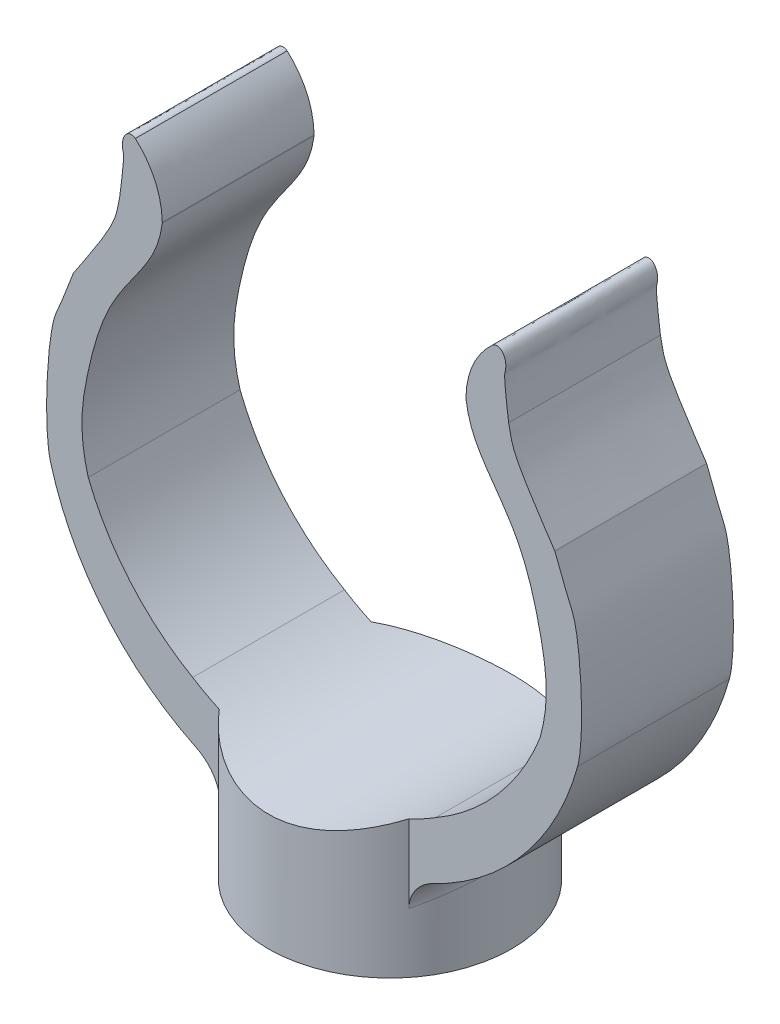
from build123d import *

# Parameters (mm, degrees)
BOSS_EXTRU_1_DEPTH      = 5
ESQUISSE2_W             = 8
ESQUISSE2_H             = 10
ENL_V_MAT_EXTRU_1_DEPTH = 10
CONG_2_R                = 2


with BuildPart() as part:
    # Esquisse1 → Boss.-Extru.1 (new, symmetric)
    with BuildSketch(Plane.XY):
        with BuildLine():
            Line((10, 27.051223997), (10, 27.101223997))
            add(Edge.make_bspline(
                [(10, 27.101223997), (10.056682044, 29.410917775), (11.772588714, 31)],
                knots=[0, 0, 0, 1, 1, 1], degree=2))
            add(Edge.make_bspline(
                [(12.814067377, 27.071239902), (12.812837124, 27.093816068), (12.484605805, 29.498084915), (12.615706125, 29.965612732), (12.703970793, 30.674854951), (12.189630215, 31.268516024), (11.772588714, 31)],
                knots=[0, 0, 0, 0, 0.319811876, 0.380234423, 0.604225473, 1, 1, 1, 1], degree=3))
            add(Edge.make_bspline(
                [(15.857886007, 21.276446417), (15.852969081, 21.289757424), (12.727655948, 25.890453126), (13.04722311, 26.185248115), (12.814067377, 27.071239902)],
                knots=[0.213455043, 0.213455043, 0.213455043, 0.213455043, 0.458677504, 1, 1, 1, 1], degree=3))
            add(Edge.make_bspline(
                [(15.857886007, 21.276446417), (16.544749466, 19.4169829), (16.946927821, 18.638172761), (17.575313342, 16.625727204), (17.823461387, 11.432994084), (17.359175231, 9.739849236)],
                knots=[0, 0, 0, 0, 0.210543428, 0.310543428, 1, 1, 1, 1], degree=3))
            ThreePointArc((17.359175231, 9.739849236), (0, -3.5), (-17.359175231, 9.739849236))
            add(Edge.make_bspline(
                [(-15.857886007, 21.276446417), (-16.544749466, 19.4169829), (-16.946927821, 18.638172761), (-17.575313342, 16.625727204), (-17.823461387, 11.432994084), (-17.359175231, 9.739849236)],
                knots=[0, 0, 0, 0, 0.210543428, 0.310543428, 1, 1, 1, 1], degree=3))
            add(Edge.make_bspline(
                [(-15.857886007, 21.276446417), (-15.852969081, 21.289757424), (-12.727655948, 25.890453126), (-13.04722311, 26.185248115), (-12.814067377, 27.071239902)],
                knots=[0.213455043, 0.213455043, 0.213455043, 0.213455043, 0.458677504, 1, 1, 1, 1], degree=3))
            add(Edge.make_bspline(
                [(-12.814067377, 27.071239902), (-12.812837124, 27.093816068), (-12.484605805, 29.498084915), (-12.615706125, 29.965612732), (-12.703970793, 30.674854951), (-12.189630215, 31.268516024), (-11.772588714, 31)],
                knots=[0, 0, 0, 0, 0.319811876, 0.380234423, 0.604225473, 1, 1, 1, 1], degree=3))
            add(Edge.make_bspline(
                [(-10, 27.101223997), (-10.056682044, 29.410917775), (-11.772588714, 31)],
                knots=[0, 0, 0, 1, 1, 1], degree=2))
            Line((-10, 27.101223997), (-10, 27.051223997))
            add(Edge.make_bspline(
                [(-10, 27.051223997), (-10.198024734, 25.52930918), (-11.356080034, 23.666593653), (-13.792474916, 20.458196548), (-15.184837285, 15.382284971), (-15.52441888, 12.40834062), (-14.876573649, 10.110385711)],
                knots=[0, 0, 0, 0, 0.203211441, 0.376639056, 0.640999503, 1, 1, 1, 1], degree=3))
            ThreePointArc((-14.876573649, 10.110385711), (0, 0), (14.876573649, 10.110385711))
            add(Edge.make_bspline(
                [(10, 27.051223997), (10.198024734, 25.52930918), (11.356080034, 23.666593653), (13.792474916, 20.458196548), (15.184837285, 15.382284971), (15.52441888, 12.40834062), (14.876573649, 10.110385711)],
                knots=[0, 0, 0, 0, 0.203211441, 0.376639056, 0.640999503, 1, 1, 1, 1], degree=3))
        make_face()
    extrude(amount=BOSS_EXTRU_1_DEPTH, both=True)

    # Esquisse2 → R_volution1 (revolve)
    with BuildSketch(Plane.XY, mode=Mode.PRIVATE) as r_volution1_sk:
        with Locations((4, -2.856406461)):
            Rectangle(ESQUISSE2_W, ESQUISSE2_H)
    revolve(r_volution1_sk.sketch.rotate(Axis((0, 2.143593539, 0), (0, -1, 0)), 180), axis=Axis((0, 2.143593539, 0), (0, -1, 0)))

    # Esquisse4 → Enl_v. mat.-Extru.1 (cut, symmetric)
    with BuildSketch(Plane.XY):
        with BuildLine():
            Line((8, 2.143593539), (-8, 2.143593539))
            ThreePointArc((-8, 2.143593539), (0, -0.16782892), (8, 2.143593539))
        make_face()
    extrude(amount=ENL_V_MAT_EXTRU_1_DEPTH, both=True, mode=Mode.SUBTRACT)

    # Cong_2
    cong_2_edges = [part.edges().sort_by_distance(p)[0] for p in [
        (-7.541432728, -1.844013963, 2.66960529),
        (8, -1.624515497, 0),
    ]]
    fillet(cong_2_edges, radius=CONG_2_R)


solid = part.part
